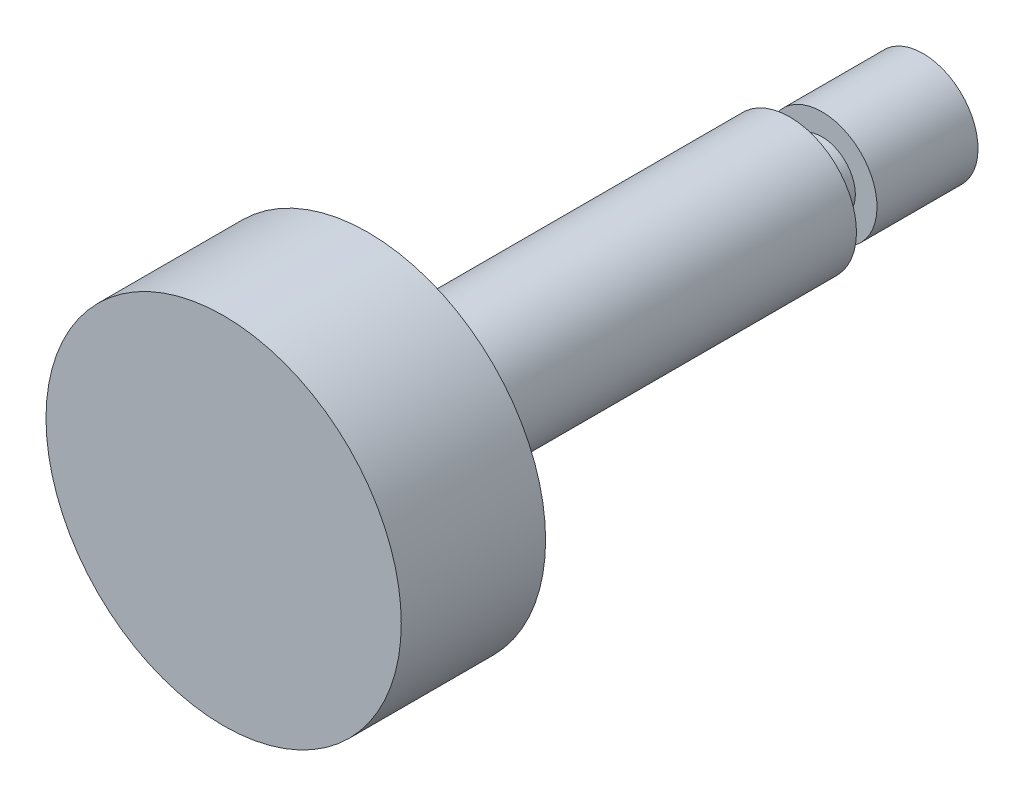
ISO-10303-21;
HEADER;
FILE_DESCRIPTION(('STEP AP214'),'2;1');
FILE_NAME('part.step','',(''),(''),'','','');
FILE_SCHEMA(('AUTOMOTIVE_DESIGN { 1 0 10303 214 1 1 1 1 }'));
ENDSEC;
DATA;
#1=APPLICATION_CONTEXT('core data for automotive mechanical design processes');
#2=APPLICATION_PROTOCOL_DEFINITION('international standard','automotive_design',2000,#1);
#3=PRODUCT_CONTEXT('',#1,'mechanical');
#4=PRODUCT('Part','Part','',(#3));
#5=PRODUCT_RELATED_PRODUCT_CATEGORY('part','',(#4));
#6=PRODUCT_DEFINITION_FORMATION('','',#4);
#7=PRODUCT_DEFINITION_CONTEXT('part definition',#1,'design');
#8=PRODUCT_DEFINITION('design','',#6,#7);
#9=PRODUCT_DEFINITION_SHAPE('','',#8);
#10=(LENGTH_UNIT() NAMED_UNIT(*) SI_UNIT(.MILLI.,.METRE.));
#11=(NAMED_UNIT(*) PLANE_ANGLE_UNIT() SI_UNIT($,.RADIAN.));
#12=(NAMED_UNIT(*) SI_UNIT($,.STERADIAN.) SOLID_ANGLE_UNIT());
#13=UNCERTAINTY_MEASURE_WITH_UNIT(LENGTH_MEASURE(1.E-05),#10,'distance_accuracy_value','');
#14=(GEOMETRIC_REPRESENTATION_CONTEXT(3) GLOBAL_UNCERTAINTY_ASSIGNED_CONTEXT((#13)) GLOBAL_UNIT_ASSIGNED_CONTEXT((#10,
#11,#12)) REPRESENTATION_CONTEXT('',''));
#15=CARTESIAN_POINT('',(0.,0.,0.));
#16=DIRECTION('',(0.,0.,1.));
#17=DIRECTION('',(1.,0.,0.));
#18=AXIS2_PLACEMENT_3D('',#15,#16,#17);
#19=CARTESIAN_POINT('',(0.,-6.,12.));
#20=DIRECTION('',(0.,0.,-1.));
#21=DIRECTION('',(0.,-1.,0.));
#22=AXIS2_PLACEMENT_3D('',#19,#20,#21);
#23=PLANE('',#22);
#24=CARTESIAN_POINT('',(0.,0.,12.));
#25=DIRECTION('',(0.,0.,1.));
#26=DIRECTION('',(0.,1.,0.));
#27=AXIS2_PLACEMENT_3D('',#24,#25,#26);
#28=CIRCLE('',#27,3.);
#29=CARTESIAN_POINT('',(0.,3.,12.));
#30=VERTEX_POINT('',#29);
#31=EDGE_CURVE('E40',#30,#30,#28,.T.);
#32=ORIENTED_EDGE('',*,*,#31,.T.);
#33=EDGE_LOOP('',(#32));
#34=FACE_BOUND('',#33,.T.);
#35=CARTESIAN_POINT('',(0.,0.,12.));
#36=DIRECTION('',(0.,0.,1.));
#37=DIRECTION('',(0.,1.,0.));
#38=AXIS2_PLACEMENT_3D('',#35,#36,#37);
#39=CIRCLE('',#38,6.);
#40=CARTESIAN_POINT('',(0.,6.,12.));
#41=VERTEX_POINT('',#40);
#42=EDGE_CURVE('E8',#41,#41,#39,.T.);
#43=ORIENTED_EDGE('',*,*,#42,.F.);
#44=EDGE_LOOP('',(#43));
#45=FACE_BOUND('',#44,.T.);
#46=ADVANCED_FACE('F12',(#34,#45),#23,.T.);
#47=CARTESIAN_POINT('',(0.,0.,20.));
#48=DIRECTION('',(0.,0.,1.));
#49=DIRECTION('',(0.,1.,0.));
#50=AXIS2_PLACEMENT_3D('',#47,#48,#49);
#51=CYLINDRICAL_SURFACE('',#50,6.);
#52=CARTESIAN_POINT('',(0.,0.,50.));
#53=DIRECTION('',(0.,0.,1.));
#54=DIRECTION('',(0.,1.,0.));
#55=AXIS2_PLACEMENT_3D('',#52,#53,#54);
#56=CIRCLE('',#55,6.);
#57=CARTESIAN_POINT('',(0.,6.,50.));
#58=VERTEX_POINT('',#57);
#59=EDGE_CURVE('E18',#58,#58,#56,.T.);
#60=ORIENTED_EDGE('',*,*,#59,.F.);
#61=EDGE_LOOP('',(#60));
#62=FACE_BOUND('',#61,.T.);
#63=ORIENTED_EDGE('',*,*,#42,.T.);
#64=EDGE_LOOP('',(#63));
#65=FACE_BOUND('',#64,.T.);
#66=ADVANCED_FACE('F59',(#62,#65),#51,.T.);
#67=CARTESIAN_POINT('',(0.,-16.,50.));
#68=DIRECTION('',(0.,0.,-1.));
#69=DIRECTION('',(0.,-1.,0.));
#70=AXIS2_PLACEMENT_3D('',#67,#68,#69);
#71=PLANE('',#70);
#72=ORIENTED_EDGE('',*,*,#59,.T.);
#73=EDGE_LOOP('',(#72));
#74=FACE_BOUND('',#73,.T.);
#75=CARTESIAN_POINT('',(0.,0.,50.));
#76=DIRECTION('',(0.,0.,1.));
#77=DIRECTION('',(0.,1.,0.));
#78=AXIS2_PLACEMENT_3D('',#75,#76,#77);
#79=CIRCLE('',#78,16.);
#80=CARTESIAN_POINT('',(0.,16.,50.));
#81=VERTEX_POINT('',#80);
#82=EDGE_CURVE('E22',#81,#81,#79,.T.);
#83=ORIENTED_EDGE('',*,*,#82,.F.);
#84=EDGE_LOOP('',(#83));
#85=FACE_BOUND('',#84,.T.);
#86=ADVANCED_FACE('F63',(#74,#85),#71,.T.);
#87=CARTESIAN_POINT('',(0.,0.,20.));
#88=DIRECTION('',(0.,0.,1.));
#89=DIRECTION('',(0.,1.,0.));
#90=AXIS2_PLACEMENT_3D('',#87,#88,#89);
#91=CYLINDRICAL_SURFACE('',#90,16.);
#92=CARTESIAN_POINT('',(0.,0.,63.));
#93=DIRECTION('',(0.,0.,1.));
#94=DIRECTION('',(0.,1.,0.));
#95=AXIS2_PLACEMENT_3D('',#92,#93,#94);
#96=CIRCLE('',#95,16.);
#97=CARTESIAN_POINT('',(0.,16.,63.));
#98=VERTEX_POINT('',#97);
#99=EDGE_CURVE('E26',#98,#98,#96,.T.);
#100=ORIENTED_EDGE('',*,*,#99,.F.);
#101=EDGE_LOOP('',(#100));
#102=FACE_BOUND('',#101,.T.);
#103=ORIENTED_EDGE('',*,*,#82,.T.);
#104=EDGE_LOOP('',(#103));
#105=FACE_BOUND('',#104,.T.);
#106=ADVANCED_FACE('F68',(#102,#105),#91,.T.);
#107=CARTESIAN_POINT('',(0.,-16.,63.));
#108=DIRECTION('',(0.,0.,-1.));
#109=DIRECTION('',(0.,-1.,0.));
#110=AXIS2_PLACEMENT_3D('',#107,#108,#109);
#111=PLANE('',#110);
#112=ORIENTED_EDGE('',*,*,#99,.T.);
#113=EDGE_LOOP('',(#112));
#114=FACE_BOUND('',#113,.T.);
#115=ADVANCED_FACE('F73',(#114),#111,.F.);
#116=CARTESIAN_POINT('',(0.,-4.95,0.));
#117=DIRECTION('',(0.,0.,-1.));
#118=DIRECTION('',(0.,-1.,0.));
#119=AXIS2_PLACEMENT_3D('',#116,#117,#118);
#120=PLANE('',#119);
#121=CARTESIAN_POINT('',(0.,0.,0.));
#122=DIRECTION('',(0.,0.,1.));
#123=DIRECTION('',(0.,1.,0.));
#124=AXIS2_PLACEMENT_3D('',#121,#122,#123);
#125=CIRCLE('',#124,4.95);
#126=CARTESIAN_POINT('',(0.,4.95,0.));
#127=VERTEX_POINT('',#126);
#128=EDGE_CURVE('E31',#127,#127,#125,.T.);
#129=ORIENTED_EDGE('',*,*,#128,.F.);
#130=EDGE_LOOP('',(#129));
#131=FACE_BOUND('',#130,.T.);
#132=ADVANCED_FACE('F77',(#131),#120,.T.);
#133=CARTESIAN_POINT('',(0.,0.,20.));
#134=DIRECTION('',(0.,0.,1.));
#135=DIRECTION('',(0.,1.,0.));
#136=AXIS2_PLACEMENT_3D('',#133,#134,#135);
#137=CYLINDRICAL_SURFACE('',#136,4.95);
#138=ORIENTED_EDGE('',*,*,#128,.T.);
#139=EDGE_LOOP('',(#138));
#140=FACE_BOUND('',#139,.T.);
#141=CARTESIAN_POINT('',(0.,0.,9.1));
#142=DIRECTION('',(0.,0.,1.));
#143=DIRECTION('',(0.,1.,0.));
#144=AXIS2_PLACEMENT_3D('',#141,#142,#143);
#145=CIRCLE('',#144,4.95);
#146=CARTESIAN_POINT('',(0.,4.95,9.1));
#147=VERTEX_POINT('',#146);
#148=EDGE_CURVE('E34',#147,#147,#145,.T.);
#149=ORIENTED_EDGE('',*,*,#148,.F.);
#150=EDGE_LOOP('',(#149));
#151=FACE_BOUND('',#150,.T.);
#152=ADVANCED_FACE('F55',(#140,#151),#137,.T.);
#153=CARTESIAN_POINT('',(0.,-3.,9.1));
#154=DIRECTION('',(0.,0.,1.));
#155=DIRECTION('',(0.,1.,0.));
#156=AXIS2_PLACEMENT_3D('',#153,#154,#155);
#157=PLANE('',#156);
#158=ORIENTED_EDGE('',*,*,#148,.T.);
#159=EDGE_LOOP('',(#158));
#160=FACE_BOUND('',#159,.T.);
#161=CARTESIAN_POINT('',(0.,0.,9.1));
#162=DIRECTION('',(0.,0.,1.));
#163=DIRECTION('',(0.,1.,0.));
#164=AXIS2_PLACEMENT_3D('',#161,#162,#163);
#165=CIRCLE('',#164,3.);
#166=CARTESIAN_POINT('',(0.,3.,9.1));
#167=VERTEX_POINT('',#166);
#168=EDGE_CURVE('E37',#167,#167,#165,.T.);
#169=ORIENTED_EDGE('',*,*,#168,.F.);
#170=EDGE_LOOP('',(#169));
#171=FACE_BOUND('',#170,.T.);
#172=ADVANCED_FACE('F48',(#160,#171),#157,.T.);
#173=CARTESIAN_POINT('',(0.,0.,20.));
#174=DIRECTION('',(0.,0.,1.));
#175=DIRECTION('',(0.,1.,0.));
#176=AXIS2_PLACEMENT_3D('',#173,#174,#175);
#177=CYLINDRICAL_SURFACE('',#176,3.);
#178=ORIENTED_EDGE('',*,*,#168,.T.);
#179=EDGE_LOOP('',(#178));
#180=FACE_BOUND('',#179,.T.);
#181=ORIENTED_EDGE('',*,*,#31,.F.);
#182=EDGE_LOOP('',(#181));
#183=FACE_BOUND('',#182,.T.);
#184=ADVANCED_FACE('F46',(#180,#183),#177,.T.);
#185=CLOSED_SHELL('',(#46,#66,#86,#106,#115,#132,#152,#172,#184));
#186=MANIFOLD_SOLID_BREP('B1',#185);
#187=ADVANCED_BREP_SHAPE_REPRESENTATION('',(#18,#186),#14);
#188=SHAPE_DEFINITION_REPRESENTATION(#9,#187);
ENDSEC;
END-ISO-10303-21;
